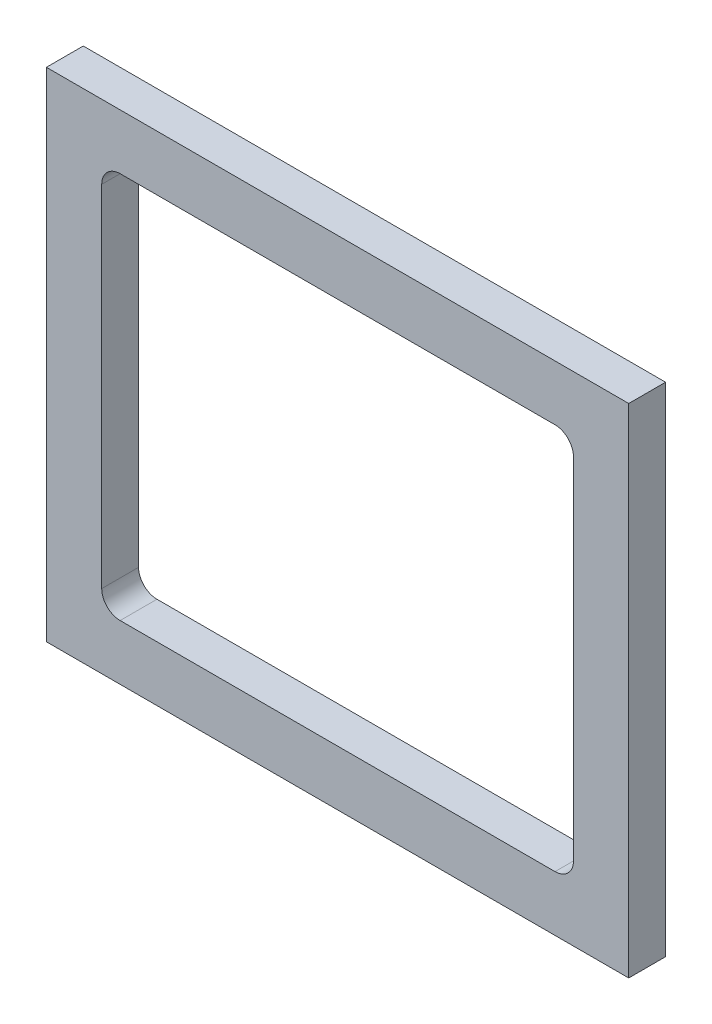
ISO-10303-21;
HEADER;
FILE_DESCRIPTION(('STEP AP214'),'2;1');
FILE_NAME('part.step','',(''),(''),'','','');
FILE_SCHEMA(('AUTOMOTIVE_DESIGN { 1 0 10303 214 1 1 1 1 }'));
ENDSEC;
DATA;
#1=APPLICATION_CONTEXT('core data for automotive mechanical design processes');
#2=APPLICATION_PROTOCOL_DEFINITION('international standard','automotive_design',2000,#1);
#3=PRODUCT_CONTEXT('',#1,'mechanical');
#4=PRODUCT('Part','Part','',(#3));
#5=PRODUCT_RELATED_PRODUCT_CATEGORY('part','',(#4));
#6=PRODUCT_DEFINITION_FORMATION('','',#4);
#7=PRODUCT_DEFINITION_CONTEXT('part definition',#1,'design');
#8=PRODUCT_DEFINITION('design','',#6,#7);
#9=PRODUCT_DEFINITION_SHAPE('','',#8);
#10=(LENGTH_UNIT() NAMED_UNIT(*) SI_UNIT(.MILLI.,.METRE.));
#11=(NAMED_UNIT(*) PLANE_ANGLE_UNIT() SI_UNIT($,.RADIAN.));
#12=(NAMED_UNIT(*) SI_UNIT($,.STERADIAN.) SOLID_ANGLE_UNIT());
#13=UNCERTAINTY_MEASURE_WITH_UNIT(LENGTH_MEASURE(1.E-05),#10,'distance_accuracy_value','');
#14=(GEOMETRIC_REPRESENTATION_CONTEXT(3) GLOBAL_UNCERTAINTY_ASSIGNED_CONTEXT((#13)) GLOBAL_UNIT_ASSIGNED_CONTEXT((#10,
#11,#12)) REPRESENTATION_CONTEXT('',''));
#15=CARTESIAN_POINT('',(0.,0.,0.));
#16=DIRECTION('',(0.,0.,1.));
#17=DIRECTION('',(1.,0.,0.));
#18=AXIS2_PLACEMENT_3D('',#15,#16,#17);
#19=CARTESIAN_POINT('',(-63.7060523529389,-85.5376529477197,10.));
#20=DIRECTION('',(0.,0.,1.));
#21=DIRECTION('',(1.,0.,0.));
#22=AXIS2_PLACEMENT_3D('',#19,#20,#21);
#23=PLANE('',#22);
#24=DIRECTION('',(0.,-1.,0.));
#25=VECTOR('',#24,1.);
#26=CARTESIAN_POINT('',(-63.7060523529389,49.4623470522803,10.));
#27=LINE('',#26,#25);
#28=CARTESIAN_POINT('',(-63.7060523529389,49.4623470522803,10.));
#29=VERTEX_POINT('',#28);
#30=CARTESIAN_POINT('',(-63.7060523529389,-85.5376529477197,10.));
#31=VERTEX_POINT('',#30);
#32=EDGE_CURVE('E185',#29,#31,#27,.T.);
#33=ORIENTED_EDGE('',*,*,#32,.T.);
#34=DIRECTION('',(1.,0.,0.));
#35=VECTOR('',#34,1.);
#36=CARTESIAN_POINT('',(-63.7060523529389,-85.5376529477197,10.));
#37=LINE('',#36,#35);
#38=CARTESIAN_POINT('',(94.2939476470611,-85.5376529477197,10.));
#39=VERTEX_POINT('',#38);
#40=EDGE_CURVE('E188',#31,#39,#37,.T.);
#41=ORIENTED_EDGE('',*,*,#40,.T.);
#42=DIRECTION('',(0.,1.,0.));
#43=VECTOR('',#42,1.);
#44=CARTESIAN_POINT('',(94.2939476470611,49.4623470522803,10.));
#45=LINE('',#44,#43);
#46=CARTESIAN_POINT('',(94.2939476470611,49.4623470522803,10.));
#47=VERTEX_POINT('',#46);
#48=EDGE_CURVE('E191',#39,#47,#45,.T.);
#49=ORIENTED_EDGE('',*,*,#48,.T.);
#50=DIRECTION('',(-1.,0.,0.));
#51=VECTOR('',#50,1.);
#52=CARTESIAN_POINT('',(-63.7060523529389,49.4623470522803,10.));
#53=LINE('',#52,#51);
#54=EDGE_CURVE('E193',#47,#29,#53,.T.);
#55=ORIENTED_EDGE('',*,*,#54,.T.);
#56=EDGE_LOOP('',(#33,#41,#49,#55));
#57=FACE_BOUND('',#56,.T.);
#58=DIRECTION('',(0.,-1.,0.));
#59=VECTOR('',#58,1.);
#60=CARTESIAN_POINT('',(-48.7060523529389,29.4623470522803,10.));
#61=LINE('',#60,#59);
#62=CARTESIAN_POINT('',(-48.7060523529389,29.4623470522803,10.));
#63=VERTEX_POINT('',#62);
#64=CARTESIAN_POINT('',(-48.7060523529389,-65.5376529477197,10.));
#65=VERTEX_POINT('',#64);
#66=EDGE_CURVE('E128',#63,#65,#61,.T.);
#67=ORIENTED_EDGE('',*,*,#66,.F.);
#68=CARTESIAN_POINT('',(-43.7060523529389,29.4623470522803,10.));
#69=DIRECTION('',(0.,0.,1.));
#70=DIRECTION('',(1.,0.,0.));
#71=AXIS2_PLACEMENT_3D('',#68,#69,#70);
#72=CIRCLE('',#71,5.);
#73=CARTESIAN_POINT('',(-43.7060523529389,34.4623470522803,10.));
#74=VERTEX_POINT('',#73);
#75=EDGE_CURVE('E120',#74,#63,#72,.T.);
#76=ORIENTED_EDGE('',*,*,#75,.F.);
#77=DIRECTION('',(-1.,0.,0.));
#78=VECTOR('',#77,1.);
#79=CARTESIAN_POINT('',(-43.7060523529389,34.4623470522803,10.));
#80=LINE('',#79,#78);
#81=CARTESIAN_POINT('',(74.2939476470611,34.4623470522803,10.));
#82=VERTEX_POINT('',#81);
#83=EDGE_CURVE('E153',#82,#74,#80,.T.);
#84=ORIENTED_EDGE('',*,*,#83,.F.);
#85=CARTESIAN_POINT('',(74.2939476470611,29.4623470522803,10.));
#86=DIRECTION('',(0.,0.,1.));
#87=DIRECTION('',(1.,0.,0.));
#88=AXIS2_PLACEMENT_3D('',#85,#86,#87);
#89=CIRCLE('',#88,5.);
#90=CARTESIAN_POINT('',(79.2939476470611,29.4623470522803,10.));
#91=VERTEX_POINT('',#90);
#92=EDGE_CURVE('E151',#91,#82,#89,.T.);
#93=ORIENTED_EDGE('',*,*,#92,.F.);
#94=DIRECTION('',(0.,1.,0.));
#95=VECTOR('',#94,1.);
#96=CARTESIAN_POINT('',(79.2939476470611,29.4623470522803,10.));
#97=LINE('',#96,#95);
#98=CARTESIAN_POINT('',(79.2939476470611,-65.5376529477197,10.));
#99=VERTEX_POINT('',#98);
#100=EDGE_CURVE('E149',#99,#91,#97,.T.);
#101=ORIENTED_EDGE('',*,*,#100,.F.);
#102=CARTESIAN_POINT('',(74.2939476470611,-65.5376529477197,10.));
#103=DIRECTION('',(0.,0.,1.));
#104=DIRECTION('',(1.,0.,0.));
#105=AXIS2_PLACEMENT_3D('',#102,#103,#104);
#106=CIRCLE('',#105,5.00000000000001);
#107=CARTESIAN_POINT('',(74.2939476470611,-70.5376529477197,10.));
#108=VERTEX_POINT('',#107);
#109=EDGE_CURVE('E147',#108,#99,#106,.T.);
#110=ORIENTED_EDGE('',*,*,#109,.F.);
#111=DIRECTION('',(1.,0.,0.));
#112=VECTOR('',#111,1.);
#113=CARTESIAN_POINT('',(-43.7060523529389,-70.5376529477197,10.));
#114=LINE('',#113,#112);
#115=CARTESIAN_POINT('',(-43.7060523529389,-70.5376529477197,10.));
#116=VERTEX_POINT('',#115);
#117=EDGE_CURVE('E143',#116,#108,#114,.T.);
#118=ORIENTED_EDGE('',*,*,#117,.F.);
#119=CARTESIAN_POINT('',(-43.7060523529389,-65.5376529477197,10.));
#120=DIRECTION('',(0.,0.,1.));
#121=DIRECTION('',(1.,0.,0.));
#122=AXIS2_PLACEMENT_3D('',#119,#120,#121);
#123=CIRCLE('',#122,5.);
#124=EDGE_CURVE('E141',#65,#116,#123,.T.);
#125=ORIENTED_EDGE('',*,*,#124,.F.);
#126=EDGE_LOOP('',(#67,#76,#84,#93,#101,#110,#118,#125));
#127=FACE_BOUND('',#126,.T.);
#128=ADVANCED_FACE('F31',(#57,#127),#23,.T.);
#129=CARTESIAN_POINT('',(-63.7060523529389,-85.5376529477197,0.));
#130=DIRECTION('',(0.,0.,1.));
#131=DIRECTION('',(1.,0.,0.));
#132=AXIS2_PLACEMENT_3D('',#129,#130,#131);
#133=PLANE('',#132);
#134=DIRECTION('',(0.,-1.,0.));
#135=VECTOR('',#134,1.);
#136=CARTESIAN_POINT('',(-63.7060523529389,49.4623470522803,0.));
#137=LINE('',#136,#135);
#138=CARTESIAN_POINT('',(-63.7060523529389,49.4623470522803,0.));
#139=VERTEX_POINT('',#138);
#140=CARTESIAN_POINT('',(-63.7060523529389,-85.5376529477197,0.));
#141=VERTEX_POINT('',#140);
#142=EDGE_CURVE('E136',#139,#141,#137,.T.);
#143=ORIENTED_EDGE('',*,*,#142,.F.);
#144=DIRECTION('',(-1.,0.,0.));
#145=VECTOR('',#144,1.);
#146=CARTESIAN_POINT('',(-63.7060523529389,49.4623470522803,0.));
#147=LINE('',#146,#145);
#148=CARTESIAN_POINT('',(94.2939476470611,49.4623470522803,0.));
#149=VERTEX_POINT('',#148);
#150=EDGE_CURVE('E189',#149,#139,#147,.T.);
#151=ORIENTED_EDGE('',*,*,#150,.F.);
#152=DIRECTION('',(0.,1.,0.));
#153=VECTOR('',#152,1.);
#154=CARTESIAN_POINT('',(94.2939476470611,49.4623470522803,0.));
#155=LINE('',#154,#153);
#156=CARTESIAN_POINT('',(94.2939476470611,-85.5376529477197,0.));
#157=VERTEX_POINT('',#156);
#158=EDGE_CURVE('E200',#157,#149,#155,.T.);
#159=ORIENTED_EDGE('',*,*,#158,.F.);
#160=DIRECTION('',(1.,0.,0.));
#161=VECTOR('',#160,1.);
#162=CARTESIAN_POINT('',(-63.7060523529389,-85.5376529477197,0.));
#163=LINE('',#162,#161);
#164=EDGE_CURVE('E198',#141,#157,#163,.T.);
#165=ORIENTED_EDGE('',*,*,#164,.F.);
#166=EDGE_LOOP('',(#143,#151,#159,#165));
#167=FACE_BOUND('',#166,.T.);
#168=CARTESIAN_POINT('',(-43.7060523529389,29.4623470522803,0.));
#169=DIRECTION('',(0.,0.,1.));
#170=DIRECTION('',(1.,0.,0.));
#171=AXIS2_PLACEMENT_3D('',#168,#169,#170);
#172=CIRCLE('',#171,5.);
#173=CARTESIAN_POINT('',(-43.7060523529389,34.4623470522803,0.));
#174=VERTEX_POINT('',#173);
#175=CARTESIAN_POINT('',(-48.7060523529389,29.4623470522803,0.));
#176=VERTEX_POINT('',#175);
#177=EDGE_CURVE('E54',#174,#176,#172,.T.);
#178=ORIENTED_EDGE('',*,*,#177,.T.);
#179=DIRECTION('',(0.,-1.,0.));
#180=VECTOR('',#179,1.);
#181=CARTESIAN_POINT('',(-48.7060523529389,29.4623470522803,0.));
#182=LINE('',#181,#180);
#183=CARTESIAN_POINT('',(-48.7060523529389,-65.5376529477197,0.));
#184=VERTEX_POINT('',#183);
#185=EDGE_CURVE('E135',#176,#184,#182,.T.);
#186=ORIENTED_EDGE('',*,*,#185,.T.);
#187=CARTESIAN_POINT('',(-43.7060523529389,-65.5376529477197,0.));
#188=DIRECTION('',(0.,0.,1.));
#189=DIRECTION('',(1.,0.,0.));
#190=AXIS2_PLACEMENT_3D('',#187,#188,#189);
#191=CIRCLE('',#190,5.);
#192=CARTESIAN_POINT('',(-43.7060523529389,-70.5376529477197,0.));
#193=VERTEX_POINT('',#192);
#194=EDGE_CURVE('E157',#184,#193,#191,.T.);
#195=ORIENTED_EDGE('',*,*,#194,.T.);
#196=DIRECTION('',(1.,0.,0.));
#197=VECTOR('',#196,1.);
#198=CARTESIAN_POINT('',(-43.7060523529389,-70.5376529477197,0.));
#199=LINE('',#198,#197);
#200=CARTESIAN_POINT('',(74.2939476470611,-70.5376529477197,0.));
#201=VERTEX_POINT('',#200);
#202=EDGE_CURVE('E160',#193,#201,#199,.T.);
#203=ORIENTED_EDGE('',*,*,#202,.T.);
#204=CARTESIAN_POINT('',(74.2939476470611,-65.5376529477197,0.));
#205=DIRECTION('',(0.,0.,1.));
#206=DIRECTION('',(1.,0.,0.));
#207=AXIS2_PLACEMENT_3D('',#204,#205,#206);
#208=CIRCLE('',#207,5.00000000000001);
#209=CARTESIAN_POINT('',(79.2939476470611,-65.5376529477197,0.));
#210=VERTEX_POINT('',#209);
#211=EDGE_CURVE('E163',#201,#210,#208,.T.);
#212=ORIENTED_EDGE('',*,*,#211,.T.);
#213=DIRECTION('',(0.,1.,0.));
#214=VECTOR('',#213,1.);
#215=CARTESIAN_POINT('',(79.2939476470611,29.4623470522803,0.));
#216=LINE('',#215,#214);
#217=CARTESIAN_POINT('',(79.2939476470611,29.4623470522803,0.));
#218=VERTEX_POINT('',#217);
#219=EDGE_CURVE('E166',#210,#218,#216,.T.);
#220=ORIENTED_EDGE('',*,*,#219,.T.);
#221=CARTESIAN_POINT('',(74.2939476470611,29.4623470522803,0.));
#222=DIRECTION('',(0.,0.,1.));
#223=DIRECTION('',(1.,0.,0.));
#224=AXIS2_PLACEMENT_3D('',#221,#222,#223);
#225=CIRCLE('',#224,5.);
#226=CARTESIAN_POINT('',(74.2939476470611,34.4623470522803,0.));
#227=VERTEX_POINT('',#226);
#228=EDGE_CURVE('E169',#218,#227,#225,.T.);
#229=ORIENTED_EDGE('',*,*,#228,.T.);
#230=DIRECTION('',(-1.,0.,0.));
#231=VECTOR('',#230,1.);
#232=CARTESIAN_POINT('',(-43.7060523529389,34.4623470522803,0.));
#233=LINE('',#232,#231);
#234=EDGE_CURVE('E129',#227,#174,#233,.T.);
#235=ORIENTED_EDGE('',*,*,#234,.T.);
#236=EDGE_LOOP('',(#178,#186,#195,#203,#212,#220,#229,#235));
#237=FACE_BOUND('',#236,.T.);
#238=ADVANCED_FACE('F218',(#167,#237),#133,.F.);
#239=CARTESIAN_POINT('',(-63.7060523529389,49.4623470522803,10.));
#240=DIRECTION('',(1.,0.,0.));
#241=DIRECTION('',(0.,1.,0.));
#242=AXIS2_PLACEMENT_3D('',#239,#240,#241);
#243=PLANE('',#242);
#244=ORIENTED_EDGE('',*,*,#142,.T.);
#245=DIRECTION('',(0.,0.,-1.));
#246=VECTOR('',#245,1.);
#247=CARTESIAN_POINT('',(-63.7060523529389,-85.5376529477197,10.));
#248=LINE('',#247,#246);
#249=EDGE_CURVE('E11',#31,#141,#248,.T.);
#250=ORIENTED_EDGE('',*,*,#249,.F.);
#251=ORIENTED_EDGE('',*,*,#32,.F.);
#252=DIRECTION('',(0.,0.,-1.));
#253=VECTOR('',#252,1.);
#254=CARTESIAN_POINT('',(-63.7060523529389,49.4623470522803,10.));
#255=LINE('',#254,#253);
#256=EDGE_CURVE('E195',#29,#139,#255,.T.);
#257=ORIENTED_EDGE('',*,*,#256,.T.);
#258=EDGE_LOOP('',(#244,#250,#251,#257));
#259=FACE_BOUND('',#258,.T.);
#260=ADVANCED_FACE('F33',(#259),#243,.F.);
#261=CARTESIAN_POINT('',(-63.7060523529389,-85.5376529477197,10.));
#262=DIRECTION('',(0.,1.,0.));
#263=DIRECTION('',(0.,0.,1.));
#264=AXIS2_PLACEMENT_3D('',#261,#262,#263);
#265=PLANE('',#264);
#266=ORIENTED_EDGE('',*,*,#164,.T.);
#267=DIRECTION('',(0.,0.,-1.));
#268=VECTOR('',#267,1.);
#269=CARTESIAN_POINT('',(94.2939476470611,-85.5376529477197,10.));
#270=LINE('',#269,#268);
#271=EDGE_CURVE('E39',#39,#157,#270,.T.);
#272=ORIENTED_EDGE('',*,*,#271,.F.);
#273=ORIENTED_EDGE('',*,*,#40,.F.);
#274=ORIENTED_EDGE('',*,*,#249,.T.);
#275=EDGE_LOOP('',(#266,#272,#273,#274));
#276=FACE_BOUND('',#275,.T.);
#277=ADVANCED_FACE('F228',(#276),#265,.F.);
#278=CARTESIAN_POINT('',(94.2939476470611,49.4623470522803,10.));
#279=DIRECTION('',(-1.,0.,0.));
#280=DIRECTION('',(0.,-1.,0.));
#281=AXIS2_PLACEMENT_3D('',#278,#279,#280);
#282=PLANE('',#281);
#283=ORIENTED_EDGE('',*,*,#158,.T.);
#284=DIRECTION('',(0.,0.,-1.));
#285=VECTOR('',#284,1.);
#286=CARTESIAN_POINT('',(94.2939476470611,49.4623470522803,10.));
#287=LINE('',#286,#285);
#288=EDGE_CURVE('E205',#47,#149,#287,.T.);
#289=ORIENTED_EDGE('',*,*,#288,.F.);
#290=ORIENTED_EDGE('',*,*,#48,.F.);
#291=ORIENTED_EDGE('',*,*,#271,.T.);
#292=EDGE_LOOP('',(#283,#289,#290,#291));
#293=FACE_BOUND('',#292,.T.);
#294=ADVANCED_FACE('F212',(#293),#282,.F.);
#295=CARTESIAN_POINT('',(-63.7060523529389,49.4623470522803,10.));
#296=DIRECTION('',(0.,-1.,0.));
#297=DIRECTION('',(0.,0.,-1.));
#298=AXIS2_PLACEMENT_3D('',#295,#296,#297);
#299=PLANE('',#298);
#300=ORIENTED_EDGE('',*,*,#150,.T.);
#301=ORIENTED_EDGE('',*,*,#256,.F.);
#302=ORIENTED_EDGE('',*,*,#54,.F.);
#303=ORIENTED_EDGE('',*,*,#288,.T.);
#304=EDGE_LOOP('',(#300,#301,#302,#303));
#305=FACE_BOUND('',#304,.T.);
#306=ADVANCED_FACE('F222',(#305),#299,.F.);
#307=CARTESIAN_POINT('',(-43.7060523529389,29.4623470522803,10.));
#308=DIRECTION('',(0.,0.,-1.));
#309=DIRECTION('',(-1.,0.,0.));
#310=AXIS2_PLACEMENT_3D('',#307,#308,#309);
#311=CYLINDRICAL_SURFACE('',#310,5.);
#312=ORIENTED_EDGE('',*,*,#177,.F.);
#313=DIRECTION('',(0.,0.,-1.));
#314=VECTOR('',#313,1.);
#315=CARTESIAN_POINT('',(-43.7060523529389,34.4623470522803,10.));
#316=LINE('',#315,#314);
#317=EDGE_CURVE('E124',#74,#174,#316,.T.);
#318=ORIENTED_EDGE('',*,*,#317,.F.);
#319=ORIENTED_EDGE('',*,*,#75,.T.);
#320=DIRECTION('',(0.,0.,-1.));
#321=VECTOR('',#320,1.);
#322=CARTESIAN_POINT('',(-48.7060523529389,29.4623470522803,10.));
#323=LINE('',#322,#321);
#324=EDGE_CURVE('E123',#63,#176,#323,.T.);
#325=ORIENTED_EDGE('',*,*,#324,.T.);
#326=EDGE_LOOP('',(#312,#318,#319,#325));
#327=FACE_BOUND('',#326,.T.);
#328=ADVANCED_FACE('F122',(#327),#311,.F.);
#329=CARTESIAN_POINT('',(-48.7060523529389,29.4623470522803,10.));
#330=DIRECTION('',(1.,0.,0.));
#331=DIRECTION('',(0.,1.,0.));
#332=AXIS2_PLACEMENT_3D('',#329,#330,#331);
#333=PLANE('',#332);
#334=ORIENTED_EDGE('',*,*,#185,.F.);
#335=ORIENTED_EDGE('',*,*,#324,.F.);
#336=ORIENTED_EDGE('',*,*,#66,.T.);
#337=DIRECTION('',(0.,0.,-1.));
#338=VECTOR('',#337,1.);
#339=CARTESIAN_POINT('',(-48.7060523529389,-65.5376529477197,10.));
#340=LINE('',#339,#338);
#341=EDGE_CURVE('E137',#65,#184,#340,.T.);
#342=ORIENTED_EDGE('',*,*,#341,.T.);
#343=EDGE_LOOP('',(#334,#335,#336,#342));
#344=FACE_BOUND('',#343,.T.);
#345=ADVANCED_FACE('F132',(#344),#333,.T.);
#346=CARTESIAN_POINT('',(-43.7060523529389,-65.5376529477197,10.));
#347=DIRECTION('',(0.,0.,-1.));
#348=DIRECTION('',(-1.,0.,0.));
#349=AXIS2_PLACEMENT_3D('',#346,#347,#348);
#350=CYLINDRICAL_SURFACE('',#349,5.);
#351=ORIENTED_EDGE('',*,*,#194,.F.);
#352=ORIENTED_EDGE('',*,*,#341,.F.);
#353=ORIENTED_EDGE('',*,*,#124,.T.);
#354=DIRECTION('',(0.,0.,-1.));
#355=VECTOR('',#354,1.);
#356=CARTESIAN_POINT('',(-43.7060523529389,-70.5376529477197,10.));
#357=LINE('',#356,#355);
#358=EDGE_CURVE('E182',#116,#193,#357,.T.);
#359=ORIENTED_EDGE('',*,*,#358,.T.);
#360=EDGE_LOOP('',(#351,#352,#353,#359));
#361=FACE_BOUND('',#360,.T.);
#362=ADVANCED_FACE('F251',(#361),#350,.F.);
#363=CARTESIAN_POINT('',(-43.7060523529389,-70.5376529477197,10.));
#364=DIRECTION('',(0.,1.,0.));
#365=DIRECTION('',(0.,0.,1.));
#366=AXIS2_PLACEMENT_3D('',#363,#364,#365);
#367=PLANE('',#366);
#368=ORIENTED_EDGE('',*,*,#202,.F.);
#369=ORIENTED_EDGE('',*,*,#358,.F.);
#370=ORIENTED_EDGE('',*,*,#117,.T.);
#371=DIRECTION('',(0.,0.,-1.));
#372=VECTOR('',#371,1.);
#373=CARTESIAN_POINT('',(74.2939476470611,-70.5376529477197,10.));
#374=LINE('',#373,#372);
#375=EDGE_CURVE('E180',#108,#201,#374,.T.);
#376=ORIENTED_EDGE('',*,*,#375,.T.);
#377=EDGE_LOOP('',(#368,#369,#370,#376));
#378=FACE_BOUND('',#377,.T.);
#379=ADVANCED_FACE('F255',(#378),#367,.T.);
#380=CARTESIAN_POINT('',(74.2939476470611,-65.5376529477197,10.));
#381=DIRECTION('',(0.,0.,-1.));
#382=DIRECTION('',(-1.,0.,0.));
#383=AXIS2_PLACEMENT_3D('',#380,#381,#382);
#384=CYLINDRICAL_SURFACE('',#383,5.00000000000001);
#385=ORIENTED_EDGE('',*,*,#211,.F.);
#386=ORIENTED_EDGE('',*,*,#375,.F.);
#387=ORIENTED_EDGE('',*,*,#109,.T.);
#388=DIRECTION('',(0.,0.,-1.));
#389=VECTOR('',#388,1.);
#390=CARTESIAN_POINT('',(79.2939476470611,-65.5376529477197,10.));
#391=LINE('',#390,#389);
#392=EDGE_CURVE('E178',#99,#210,#391,.T.);
#393=ORIENTED_EDGE('',*,*,#392,.T.);
#394=EDGE_LOOP('',(#385,#386,#387,#393));
#395=FACE_BOUND('',#394,.T.);
#396=ADVANCED_FACE('F261',(#395),#384,.F.);
#397=CARTESIAN_POINT('',(79.2939476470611,29.4623470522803,10.));
#398=DIRECTION('',(-1.,0.,0.));
#399=DIRECTION('',(0.,-1.,0.));
#400=AXIS2_PLACEMENT_3D('',#397,#398,#399);
#401=PLANE('',#400);
#402=ORIENTED_EDGE('',*,*,#219,.F.);
#403=ORIENTED_EDGE('',*,*,#392,.F.);
#404=ORIENTED_EDGE('',*,*,#100,.T.);
#405=DIRECTION('',(0.,0.,-1.));
#406=VECTOR('',#405,1.);
#407=CARTESIAN_POINT('',(79.2939476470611,29.4623470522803,10.));
#408=LINE('',#407,#406);
#409=EDGE_CURVE('E176',#91,#218,#408,.T.);
#410=ORIENTED_EDGE('',*,*,#409,.T.);
#411=EDGE_LOOP('',(#402,#403,#404,#410));
#412=FACE_BOUND('',#411,.T.);
#413=ADVANCED_FACE('F265',(#412),#401,.T.);
#414=CARTESIAN_POINT('',(74.2939476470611,29.4623470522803,10.));
#415=DIRECTION('',(0.,0.,-1.));
#416=DIRECTION('',(-1.,0.,0.));
#417=AXIS2_PLACEMENT_3D('',#414,#415,#416);
#418=CYLINDRICAL_SURFACE('',#417,5.);
#419=ORIENTED_EDGE('',*,*,#228,.F.);
#420=ORIENTED_EDGE('',*,*,#409,.F.);
#421=ORIENTED_EDGE('',*,*,#92,.T.);
#422=DIRECTION('',(0.,0.,-1.));
#423=VECTOR('',#422,1.);
#424=CARTESIAN_POINT('',(74.2939476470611,34.4623470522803,10.));
#425=LINE('',#424,#423);
#426=EDGE_CURVE('E46',#82,#227,#425,.T.);
#427=ORIENTED_EDGE('',*,*,#426,.T.);
#428=EDGE_LOOP('',(#419,#420,#421,#427));
#429=FACE_BOUND('',#428,.T.);
#430=ADVANCED_FACE('F269',(#429),#418,.F.);
#431=CARTESIAN_POINT('',(-43.7060523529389,34.4623470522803,10.));
#432=DIRECTION('',(0.,-1.,0.));
#433=DIRECTION('',(0.,0.,-1.));
#434=AXIS2_PLACEMENT_3D('',#431,#432,#433);
#435=PLANE('',#434);
#436=ORIENTED_EDGE('',*,*,#234,.F.);
#437=ORIENTED_EDGE('',*,*,#426,.F.);
#438=ORIENTED_EDGE('',*,*,#83,.T.);
#439=ORIENTED_EDGE('',*,*,#317,.T.);
#440=EDGE_LOOP('',(#436,#437,#438,#439));
#441=FACE_BOUND('',#440,.T.);
#442=ADVANCED_FACE('F273',(#441),#435,.T.);
#443=CLOSED_SHELL('',(#128,#238,#260,#277,#294,#306,#328,#345,#362,#379,#396,#413,#430,#442));
#444=MANIFOLD_SOLID_BREP('B2',#443);
#445=ADVANCED_BREP_SHAPE_REPRESENTATION('',(#18,#444),#14);
#446=SHAPE_DEFINITION_REPRESENTATION(#9,#445);
ENDSEC;
END-ISO-10303-21;
